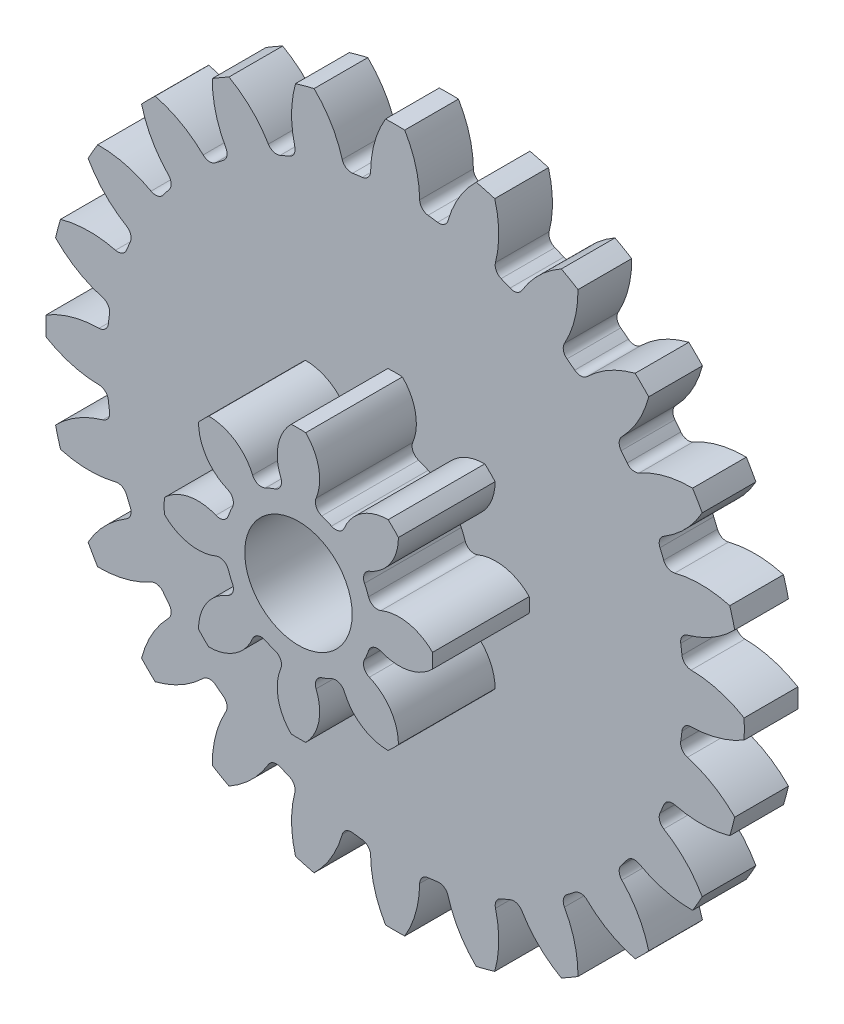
from build123d import *

# Parameters (mm, degrees)
BOSS_EXTRU_1_DEPTH                 = 1
CONG_1_R                           = 0.175
R_P_TITION_CIRCULAIRE4_COUNT       = 24
CONG_1_OF_R_P_TITION_CIRCULAIRE4_R = 0.175
BOSS_EXTRU_2_DEPTH                 = 1.8
CONG_2_R                           = 0.175
R_P_TITION_CIRCULAIRE5_COUNT       = 8
CONG_2_OF_R_P_TITION_CIRCULAIRE5_R = 0.175
ESQUISSE10_R                       = 1
ENL_V_MAT_EXTRU_4_DEPTH            = 11.943610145


with BuildPart() as part:
    # Esquisse3 → Boss.-Extru.1 (new body)
    with BuildSketch(Plane.XY):
        with BuildLine():
            Line((-2.080285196, 4.768663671), (-1.378706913, -0.560352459))
            Line((-1.378706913, -0.560352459), (-0.67712863, 4.768663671))
            ThreePointArc((-0.67712863, 4.768663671), (-0.801249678, 4.783538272), (-0.925683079, 4.795522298))
            ThreePointArc((-0.925683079, 4.795522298), (-0.976322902, 5.387111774), (-1.199841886, 5.937186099))
            ThreePointArc((-1.199841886, 5.937186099), (-1.378706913, 5.939647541), (-1.55757194, 5.937186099))
            ThreePointArc((-1.55757194, 5.937186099), (-1.781090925, 5.387111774), (-1.831730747, 4.795522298))
            ThreePointArc((-1.831730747, 4.795522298), (-1.956164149, 4.783538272), (-2.080285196, 4.768663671))
        make_face()
    boss_extru_1 = extrude(amount=BOSS_EXTRU_1_DEPTH)

    # Cong_1
    cong_1_edges = [part.edges().sort_by_distance(p)[0] for p in [
        (-1.831730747, 4.795522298, 0.5),
        (-0.925683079, 4.795522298, 0.5),
    ]]
    fillet(cong_1_edges, radius=CONG_1_R)

    # R_p_tition circulaire4: Boss.-Extru.1 ×24 about axis
    r_p_tition_circulaire4_axis = Axis((-1.378706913, -0.560352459, 0), (0, 0, 1))
    for i in range(1, R_P_TITION_CIRCULAIRE4_COUNT):
        add(boss_extru_1.rotate(r_p_tition_circulaire4_axis, i * 360 / R_P_TITION_CIRCULAIRE4_COUNT))

    # Cong_1 of R_p_tition circulaire4
    cong_1_of_r_p_tition_circulaire4_edges = [part.edges().sort_by_distance(p)[0] for p in [
        (-3.202496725, 4.495774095, 0.5),
        (-2.327321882, 4.730276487, 0.5),
        (-4.44897444, 3.851459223, 0.5),
        (-3.664314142, 4.304483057, 0.5),
        (-5.486218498, 2.906486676, 0.5),
        (-4.845546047, 3.547159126, 0.5),
        (-6.243542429, 1.725254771, 0.5),
        (-5.790518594, 2.509915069, 0.5),
        (-6.669335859, 0.38826251, 0.5),
        (-6.434833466, 1.263437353, 0.5),
        (-6.734581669, -1.013376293, 0.5),
        (-6.734581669, -0.107328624, 0.5),
        (-6.434833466, -2.38414227, 0.5),
        (-6.669335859, -1.508967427, 0.5),
        (-5.790518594, -3.630619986, 0.5),
        (-6.243542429, -2.845959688, 0.5),
        (-4.845546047, -4.667864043, 0.5),
        (-5.486218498, -4.027191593, 0.5),
        (-3.664314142, -5.425187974, 0.5),
        (-4.44897444, -4.97216414, 0.5),
        (-2.327321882, -5.850981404, 0.5),
        (-3.202496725, -5.616479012, 0.5),
        (-0.925683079, -5.916227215, 0.5),
        (-1.831730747, -5.916227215, 0.5),
        (0.445082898, -5.616479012, 0.5),
        (-0.430091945, -5.850981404, 0.5),
        (1.691560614, -4.97216414, 0.5),
        (0.906900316, -5.425187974, 0.5),
        (2.728804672, -4.027191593, 0.5),
        (2.088132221, -4.667864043, 0.5),
        (3.486128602, -2.845959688, 0.5),
        (3.033104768, -3.630619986, 0.5),
        (3.911922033, -1.508967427, 0.5),
        (3.67741964, -2.38414227, 0.5),
        (3.977167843, -0.107328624, 0.5),
        (3.977167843, -1.013376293, 0.5),
        (3.67741964, 1.263437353, 0.5),
        (3.911922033, 0.38826251, 0.5),
        (3.033104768, 2.509915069, 0.5),
        (3.486128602, 1.725254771, 0.5),
        (2.088132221, 3.547159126, 0.5),
        (2.728804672, 2.906486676, 0.5),
        (0.906900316, 4.304483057, 0.5),
        (1.691560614, 3.851459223, 0.5),
        (-0.430091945, 4.730276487, 0.5),
        (0.445082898, 4.495774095, 0.5),
    ]]
    fillet(cong_1_of_r_p_tition_circulaire4_edges, radius=CONG_1_OF_R_P_TITION_CIRCULAIRE4_R)

    # Esquisse8 → Boss.-Extru.2 (add)
    with BuildSketch(Plane.XY.offset(1)):
        with BuildLine():
            Line((-1.904896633, 0.709981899), (-1.378706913, -0.560352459))
            Line((-1.378706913, -0.560352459), (-0.852517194, 0.709981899))
            ThreePointArc((-0.852517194, 0.709981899), (-0.999269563, 0.761257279), (-1.150871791, 0.795640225))
            ThreePointArc((-1.150871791, 0.795640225), (-0.986845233, 1.382889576), (-1.243458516, 1.935986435))
            ThreePointArc((-1.243458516, 1.935986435), (-1.378706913, 1.939647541), (-1.51395531, 1.935986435))
            ThreePointArc((-1.51395531, 1.935986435), (-1.770568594, 1.382889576), (-1.606542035, 0.795640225))
            ThreePointArc((-1.606542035, 0.795640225), (-1.758144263, 0.761257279), (-1.904896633, 0.709981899))
        make_face()
    boss_extru_2 = extrude(amount=BOSS_EXTRU_2_DEPTH)

    # Cong_2
    cong_2_edges = [part.edges().sort_by_distance(p)[0] for p in [
        (-1.150871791, 0.795640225, 1.9),
        (-1.606542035, 0.795640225, 1.9),
    ]]
    fillet(cong_2_edges, radius=CONG_2_R)

    # R_p_tition circulaire5: Boss.-Extru.2 ×8 about axis
    r_p_tition_circulaire5_axis = Axis((-1.378706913, -0.560352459, 0), (0, 0, 1))
    for i in range(1, R_P_TITION_CIRCULAIRE5_COUNT):
        add(boss_extru_2.rotate(r_p_tition_circulaire5_axis, i * 360 / R_P_TITION_CIRCULAIRE5_COUNT))

    # Cong_2 of R_p_tition circulaire5
    cong_2_of_r_p_tition_circulaire5_edges = [part.edges().sort_by_distance(p)[0] for p in [
        (-2.176434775, 0.559582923, 1.9),
        (-2.498642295, 0.237375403, 1.9),
        (-2.734699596, -0.332517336, 1.9),
        (-2.734699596, -0.788187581, 1.9),
        (-2.498642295, -1.35808032, 1.9),
        (-2.176434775, -1.68028784, 1.9),
        (-1.606542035, -1.916345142, 1.9),
        (-1.150871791, -1.916345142, 1.9),
        (-0.580979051, -1.68028784, 1.9),
        (-0.258771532, -1.35808032, 1.9),
        (-0.02271423, -0.788187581, 1.9),
        (-0.02271423, -0.332517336, 1.9),
        (-0.258771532, 0.237375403, 1.9),
        (-0.580979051, 0.559582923, 1.9),
    ]]
    fillet(cong_2_of_r_p_tition_circulaire5_edges, radius=CONG_2_OF_R_P_TITION_CIRCULAIRE5_R)

    # Esquisse10 → Enl_v. mat.-Extru.4 (cut, through all)
    with BuildSketch(Plane.XY):
        with Locations((-1.378706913, -0.560352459)):
            Circle(ESQUISSE10_R)
    extrude(amount=ENL_V_MAT_EXTRU_4_DEPTH, mode=Mode.SUBTRACT)


solid = part.part
